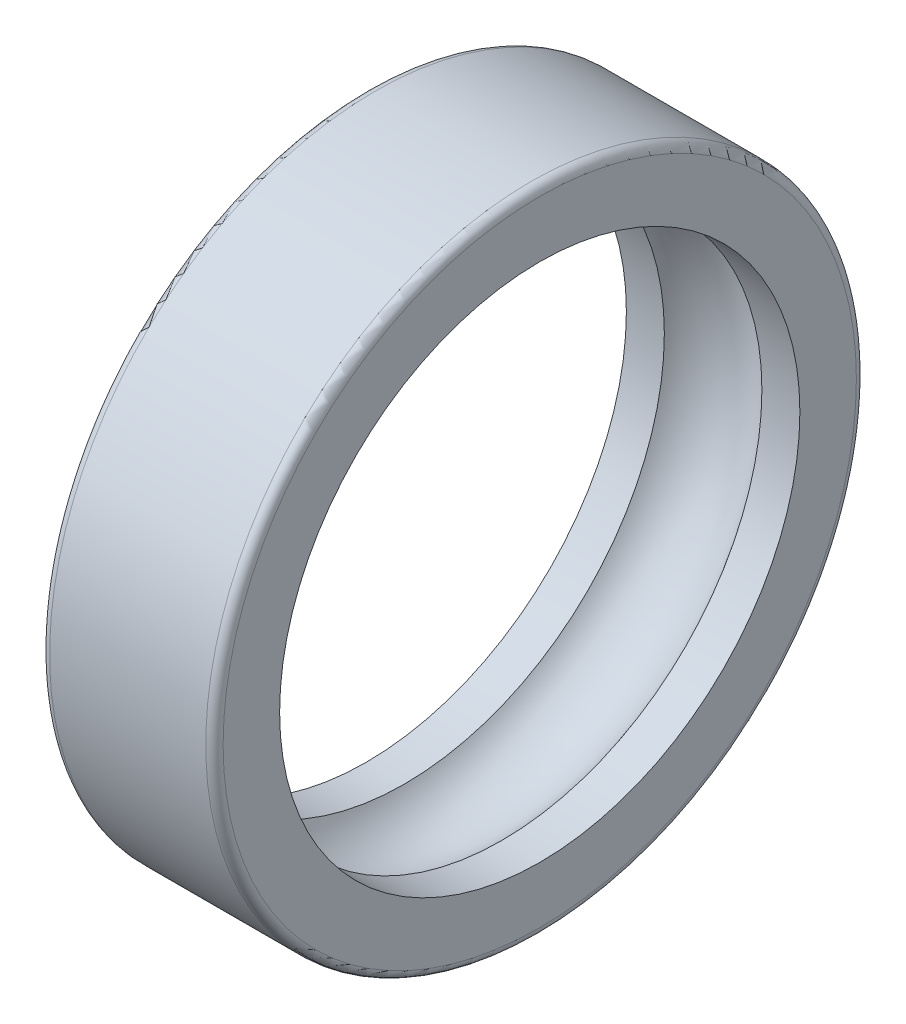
ISO-10303-21;
HEADER;
FILE_DESCRIPTION(('STEP AP214'),'2;1');
FILE_NAME('part.step','',(''),(''),'','','');
FILE_SCHEMA(('AUTOMOTIVE_DESIGN { 1 0 10303 214 1 1 1 1 }'));
ENDSEC;
DATA;
#1=APPLICATION_CONTEXT('core data for automotive mechanical design processes');
#2=APPLICATION_PROTOCOL_DEFINITION('international standard','automotive_design',2000,#1);
#3=PRODUCT_CONTEXT('',#1,'mechanical');
#4=PRODUCT('Part','Part','',(#3));
#5=PRODUCT_RELATED_PRODUCT_CATEGORY('part','',(#4));
#6=PRODUCT_DEFINITION_FORMATION('','',#4);
#7=PRODUCT_DEFINITION_CONTEXT('part definition',#1,'design');
#8=PRODUCT_DEFINITION('design','',#6,#7);
#9=PRODUCT_DEFINITION_SHAPE('','',#8);
#10=(LENGTH_UNIT() NAMED_UNIT(*) SI_UNIT(.MILLI.,.METRE.));
#11=(NAMED_UNIT(*) PLANE_ANGLE_UNIT() SI_UNIT($,.RADIAN.));
#12=(NAMED_UNIT(*) SI_UNIT($,.STERADIAN.) SOLID_ANGLE_UNIT());
#13=UNCERTAINTY_MEASURE_WITH_UNIT(LENGTH_MEASURE(1.E-05),#10,'distance_accuracy_value','');
#14=(GEOMETRIC_REPRESENTATION_CONTEXT(3) GLOBAL_UNCERTAINTY_ASSIGNED_CONTEXT((#13)) GLOBAL_UNIT_ASSIGNED_CONTEXT((#10,
#11,#12)) REPRESENTATION_CONTEXT('',''));
#15=CARTESIAN_POINT('',(0.,0.,0.));
#16=DIRECTION('',(0.,0.,1.));
#17=DIRECTION('',(1.,0.,0.));
#18=AXIS2_PLACEMENT_3D('',#15,#16,#17);
#19=CARTESIAN_POINT('',(0.400000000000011,0.,0.));
#20=DIRECTION('',(-1.,0.,0.));
#21=DIRECTION('',(0.,-1.,0.));
#22=AXIS2_PLACEMENT_3D('',#19,#20,#21);
#23=TOROIDAL_SURFACE('',#22,14.6,0.400000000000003);
#24=CARTESIAN_POINT('',(0.,0.,0.));
#25=DIRECTION('',(-1.,0.,0.));
#26=DIRECTION('',(0.,-1.,0.));
#27=AXIS2_PLACEMENT_3D('',#24,#25,#26);
#28=CIRCLE('',#27,14.6);
#29=CARTESIAN_POINT('',(0.,-14.6,0.));
#30=VERTEX_POINT('',#29);
#31=EDGE_CURVE('E10',#30,#30,#28,.T.);
#32=ORIENTED_EDGE('',*,*,#31,.F.);
#33=EDGE_LOOP('',(#32));
#34=FACE_BOUND('',#33,.T.);
#35=CARTESIAN_POINT('',(0.400000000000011,0.,0.));
#36=DIRECTION('',(-1.,0.,0.));
#37=DIRECTION('',(0.,-1.,0.));
#38=AXIS2_PLACEMENT_3D('',#35,#36,#37);
#39=CIRCLE('',#38,15.);
#40=CARTESIAN_POINT('',(0.400000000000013,-15.,0.));
#41=VERTEX_POINT('',#40);
#42=EDGE_CURVE('E60',#41,#41,#39,.T.);
#43=ORIENTED_EDGE('',*,*,#42,.T.);
#44=EDGE_LOOP('',(#43));
#45=FACE_BOUND('',#44,.T.);
#46=ADVANCED_FACE('F32',(#34,#45),#23,.T.);
#47=CARTESIAN_POINT('',(0.,14.6,0.));
#48=DIRECTION('',(1.,0.,0.));
#49=DIRECTION('',(0.,1.,0.));
#50=AXIS2_PLACEMENT_3D('',#47,#48,#49);
#51=PLANE('',#50);
#52=CARTESIAN_POINT('',(0.,0.,0.));
#53=DIRECTION('',(-1.,0.,0.));
#54=DIRECTION('',(0.,-1.,0.));
#55=AXIS2_PLACEMENT_3D('',#52,#53,#54);
#56=CIRCLE('',#55,11.994);
#57=CARTESIAN_POINT('',(0.,-11.994,0.));
#58=VERTEX_POINT('',#57);
#59=EDGE_CURVE('E38',#58,#58,#56,.T.);
#60=ORIENTED_EDGE('',*,*,#59,.F.);
#61=EDGE_LOOP('',(#60));
#62=FACE_BOUND('',#61,.T.);
#63=ORIENTED_EDGE('',*,*,#31,.T.);
#64=EDGE_LOOP('',(#63));
#65=FACE_BOUND('',#64,.T.);
#66=ADVANCED_FACE('F97',(#62,#65),#51,.F.);
#67=CARTESIAN_POINT('',(8.00000000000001,1.11022302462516E-13,0.));
#68=DIRECTION('',(-1.,0.,0.));
#69=DIRECTION('',(0.,-1.,0.));
#70=AXIS2_PLACEMENT_3D('',#67,#68,#69);
#71=CYLINDRICAL_SURFACE('',#70,11.994);
#72=CARTESIAN_POINT('',(1.75100822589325,-1.38777878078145E-13,0.));
#73=DIRECTION('',(-1.,0.,0.));
#74=DIRECTION('',(0.,-1.,0.));
#75=AXIS2_PLACEMENT_3D('',#72,#73,#74);
#76=CIRCLE('',#75,11.994);
#77=CARTESIAN_POINT('',(1.75100822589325,-11.9940000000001,0.));
#78=VERTEX_POINT('',#77);
#79=EDGE_CURVE('E42',#78,#78,#76,.T.);
#80=ORIENTED_EDGE('',*,*,#79,.F.);
#81=EDGE_LOOP('',(#80));
#82=FACE_BOUND('',#81,.T.);
#83=ORIENTED_EDGE('',*,*,#59,.T.);
#84=EDGE_LOOP('',(#83));
#85=FACE_BOUND('',#84,.T.);
#86=ADVANCED_FACE('F92',(#82,#85),#71,.F.);
#87=CARTESIAN_POINT('',(4.,-1.38777878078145E-13,0.));
#88=DIRECTION('',(-1.,0.,0.));
#89=DIRECTION('',(0.,-1.,0.));
#90=AXIS2_PLACEMENT_3D('',#87,#88,#89);
#91=TOROIDAL_SURFACE('',#90,10.5,2.7);
#92=CARTESIAN_POINT('',(6.24899177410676,0.,0.));
#93=DIRECTION('',(-1.,0.,0.));
#94=DIRECTION('',(0.,-1.,0.));
#95=AXIS2_PLACEMENT_3D('',#92,#93,#94);
#96=CIRCLE('',#95,11.994);
#97=CARTESIAN_POINT('',(6.24899177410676,-11.994,0.));
#98=VERTEX_POINT('',#97);
#99=EDGE_CURVE('E46',#98,#98,#96,.T.);
#100=ORIENTED_EDGE('',*,*,#99,.F.);
#101=EDGE_LOOP('',(#100));
#102=FACE_BOUND('',#101,.T.);
#103=ORIENTED_EDGE('',*,*,#79,.T.);
#104=EDGE_LOOP('',(#103));
#105=FACE_BOUND('',#104,.T.);
#106=ADVANCED_FACE('F86',(#102,#105),#91,.F.);
#107=CARTESIAN_POINT('',(8.00000000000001,1.11022302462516E-13,0.));
#108=DIRECTION('',(-1.,0.,0.));
#109=DIRECTION('',(0.,-1.,0.));
#110=AXIS2_PLACEMENT_3D('',#107,#108,#109);
#111=CYLINDRICAL_SURFACE('',#110,11.994);
#112=CARTESIAN_POINT('',(8.00000000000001,1.11022302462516E-13,0.));
#113=DIRECTION('',(-1.,0.,0.));
#114=DIRECTION('',(0.,-1.,0.));
#115=AXIS2_PLACEMENT_3D('',#112,#113,#114);
#116=CIRCLE('',#115,11.994);
#117=CARTESIAN_POINT('',(8.00000000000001,-11.9939999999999,0.));
#118=VERTEX_POINT('',#117);
#119=EDGE_CURVE('E51',#118,#118,#116,.T.);
#120=ORIENTED_EDGE('',*,*,#119,.F.);
#121=EDGE_LOOP('',(#120));
#122=FACE_BOUND('',#121,.T.);
#123=ORIENTED_EDGE('',*,*,#99,.T.);
#124=EDGE_LOOP('',(#123));
#125=FACE_BOUND('',#124,.T.);
#126=ADVANCED_FACE('F80',(#122,#125),#111,.F.);
#127=CARTESIAN_POINT('',(8.00000000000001,11.9940000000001,0.));
#128=DIRECTION('',(-1.,0.,0.));
#129=DIRECTION('',(0.,-1.,0.));
#130=AXIS2_PLACEMENT_3D('',#127,#128,#129);
#131=PLANE('',#130);
#132=CARTESIAN_POINT('',(8.00000000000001,1.11022302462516E-13,0.));
#133=DIRECTION('',(-1.,0.,0.));
#134=DIRECTION('',(0.,-1.,0.));
#135=AXIS2_PLACEMENT_3D('',#132,#133,#134);
#136=CIRCLE('',#135,14.6);
#137=CARTESIAN_POINT('',(8.00000000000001,-14.5999999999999,0.));
#138=VERTEX_POINT('',#137);
#139=EDGE_CURVE('E54',#138,#138,#136,.T.);
#140=ORIENTED_EDGE('',*,*,#139,.F.);
#141=EDGE_LOOP('',(#140));
#142=FACE_BOUND('',#141,.T.);
#143=ORIENTED_EDGE('',*,*,#119,.T.);
#144=EDGE_LOOP('',(#143));
#145=FACE_BOUND('',#144,.T.);
#146=ADVANCED_FACE('F74',(#142,#145),#131,.F.);
#147=CARTESIAN_POINT('',(7.6,1.11022302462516E-13,0.));
#148=DIRECTION('',(-1.,0.,0.));
#149=DIRECTION('',(0.,-1.,0.));
#150=AXIS2_PLACEMENT_3D('',#147,#148,#149);
#151=TOROIDAL_SURFACE('',#150,14.6,0.400000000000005);
#152=CARTESIAN_POINT('',(7.6,1.11022302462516E-13,0.));
#153=DIRECTION('',(-1.,0.,0.));
#154=DIRECTION('',(0.,-1.,0.));
#155=AXIS2_PLACEMENT_3D('',#152,#153,#154);
#156=CIRCLE('',#155,15.);
#157=CARTESIAN_POINT('',(7.6,-14.9999999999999,0.));
#158=VERTEX_POINT('',#157);
#159=EDGE_CURVE('E57',#158,#158,#156,.T.);
#160=ORIENTED_EDGE('',*,*,#159,.F.);
#161=EDGE_LOOP('',(#160));
#162=FACE_BOUND('',#161,.T.);
#163=ORIENTED_EDGE('',*,*,#139,.T.);
#164=EDGE_LOOP('',(#163));
#165=FACE_BOUND('',#164,.T.);
#166=ADVANCED_FACE('F68',(#162,#165),#151,.T.);
#167=CARTESIAN_POINT('',(8.00000000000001,1.11022302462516E-13,0.));
#168=DIRECTION('',(-1.,0.,0.));
#169=DIRECTION('',(0.,-1.,0.));
#170=AXIS2_PLACEMENT_3D('',#167,#168,#169);
#171=CYLINDRICAL_SURFACE('',#170,15.);
#172=ORIENTED_EDGE('',*,*,#42,.F.);
#173=EDGE_LOOP('',(#172));
#174=FACE_BOUND('',#173,.T.);
#175=ORIENTED_EDGE('',*,*,#159,.T.);
#176=EDGE_LOOP('',(#175));
#177=FACE_BOUND('',#176,.T.);
#178=ADVANCED_FACE('F65',(#174,#177),#171,.T.);
#179=CLOSED_SHELL('',(#46,#66,#86,#106,#126,#146,#166,#178));
#180=MANIFOLD_SOLID_BREP('B2',#179);
#181=ADVANCED_BREP_SHAPE_REPRESENTATION('',(#18,#180),#14);
#182=SHAPE_DEFINITION_REPRESENTATION(#9,#181);
ENDSEC;
END-ISO-10303-21;
